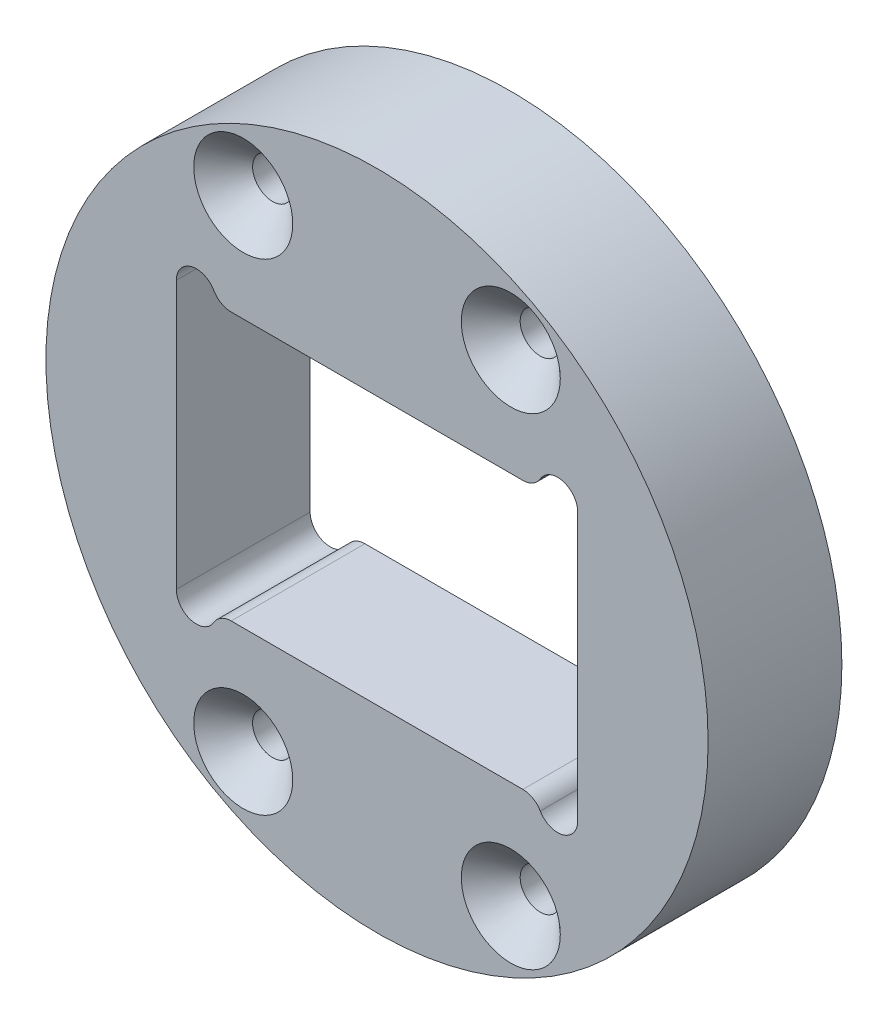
from build123d import *

# Parameters (mm, degrees)
ESQUISSE1_R        = 24.75
ESQUISSE1_R_2      = 1.5
BOSS_EXTRU_1_DEPTH = 10
CHANFREIN1_SIZE    = 2.2


with BuildPart() as part:
    # Esquisse1 → Boss.-Extru.1 (new body)
    with BuildSketch(Plane.XY):
        Circle(ESQUISSE1_R)
        with Locations((-10, 18)):
            Circle(ESQUISSE1_R_2, mode=Mode.SUBTRACT)
        with Locations((10, 18)):
            Circle(ESQUISSE1_R_2, mode=Mode.SUBTRACT)
        with Locations(Location((10, -18, 0), (0, 0, 180))):
            Circle(ESQUISSE1_R_2, mode=Mode.SUBTRACT)
        with Locations(Location((-10, -18, 0), (0, 0, 180))):
            Circle(ESQUISSE1_R_2, mode=Mode.SUBTRACT)
        with BuildLine():
            Line((-10.901923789, 10), (10.901923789, 10))
            ThreePointArc((10.901923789, 10), (11.651923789, 10.200961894), (12.200961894, 10.75))
            ThreePointArc((12.200961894, 10.75), (13.888228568, 11.448888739), (15, 10))
            Line((15, 10), (15, -10))
            ThreePointArc((15, -10), (13.888228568, -11.448888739), (12.200961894, -10.75))
            ThreePointArc((12.200961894, -10.75), (11.651923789, -10.200961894), (10.901923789, -10))
            Line((10.901923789, -10), (-10.901923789, -10))
            ThreePointArc((-10.901923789, -10), (-11.651923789, -10.200961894), (-12.200961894, -10.75))
            ThreePointArc((-12.200961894, -10.75), (-13.888228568, -11.448888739), (-15, -10))
            Line((-15, -10), (-15, 10))
            ThreePointArc((-15, 10), (-13.888228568, 11.448888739), (-12.200961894, 10.75))
            ThreePointArc((-12.200961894, 10.75), (-11.651923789, 10.200961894), (-10.901923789, 10))
        make_face(mode=Mode.SUBTRACT)
    extrude(amount=BOSS_EXTRU_1_DEPTH)

    # Chanfrein1
    chanfrein1_edges = [part.edges().sort_by_distance(p)[0] for p in [
        (8.5, 18, 10),
        (11.5, -18, 10),
        (-11.5, 18, 10),
        (-8.5, -18, 10),
    ]]
    chamfer(chanfrein1_edges, length=CHANFREIN1_SIZE)


solid = part.part
